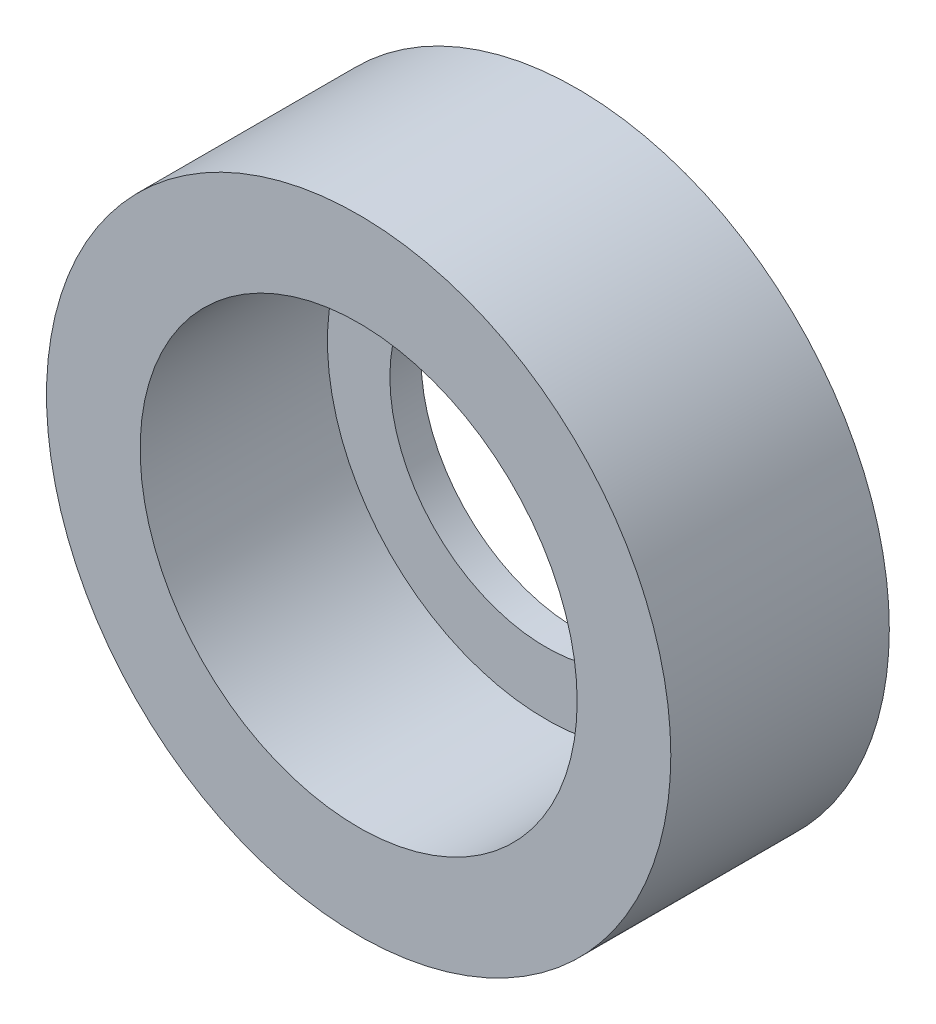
from build123d import *

# Parameters (mm, degrees)
ESQUISSE1_R               = 5
EXTRUSION1_DEPTH          = 3.5
TROU_TARAUD_M8X1_01_D     = 7
TROU_TARAUD_M8X1_01_DEPTH = 3
ESQUISSE4_R               = 2.5
ENL_V_MAT_EXTRU_1_DEPTH   = 8.889866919


with BuildPart() as part:
    # Esquisse1 → Extrusion1 (new body)
    with BuildSketch(Plane.XY):
        Circle(ESQUISSE1_R)
    extrude(amount=EXTRUSION1_DEPTH)

    # Trou taraud_ M8x1.01
    with Locations(Plane.XY.offset(3.5)):
        with Locations((0, 0)):
            Hole(TROU_TARAUD_M8X1_01_D / 2, depth=TROU_TARAUD_M8X1_01_DEPTH)

    # Esquisse4 → Enl_v. mat.-Extru.1 (cut, through all)
    with BuildSketch(Plane(origin=(0, 0, 0), x_dir=(-1, 0, 0), z_dir=(0, 0, -1))):
        Circle(ESQUISSE4_R)
    extrude(amount=-ENL_V_MAT_EXTRU_1_DEPTH, mode=Mode.SUBTRACT)


solid = part.part
